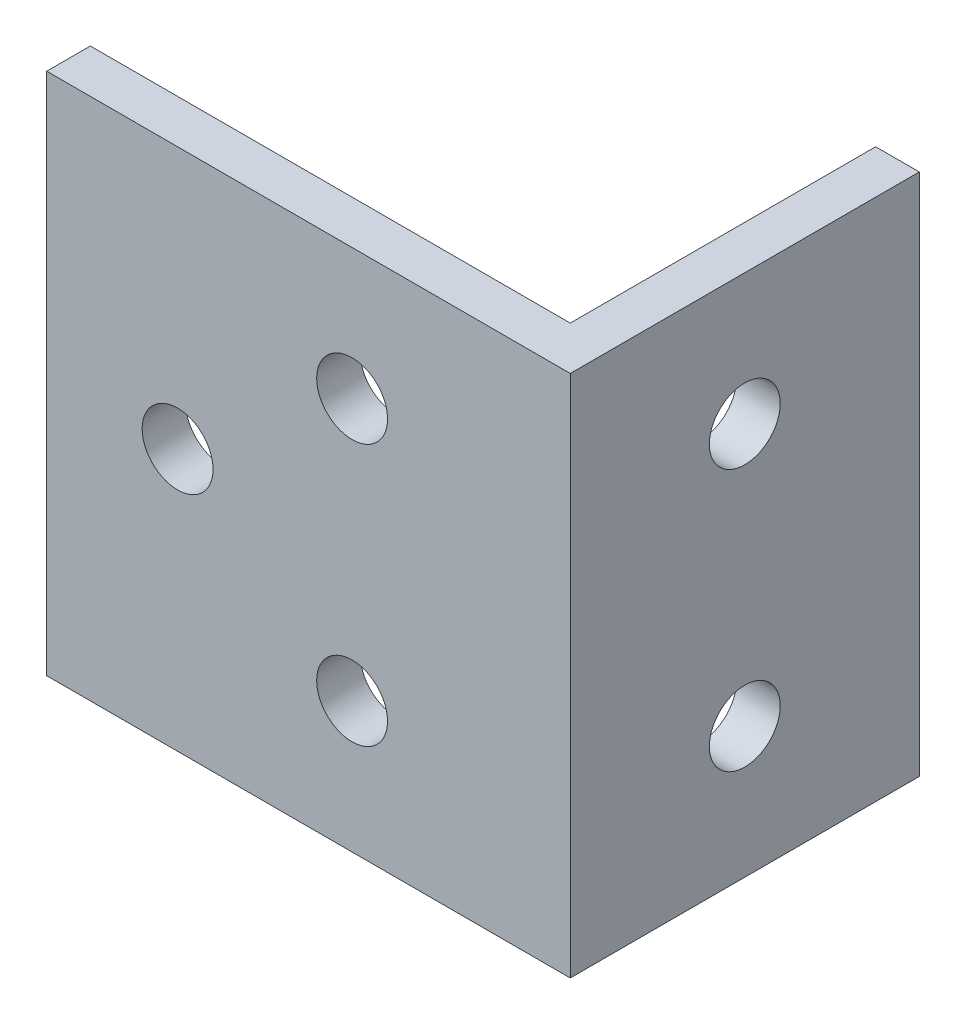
from build123d import *

# Parameters (mm, degrees)
SKETCH1_W          = 152.4
SKETCH1_H          = 152.4
EXTRUDE1_DEPTH     = 12.7
SKETCH2_W          = 12.7
SKETCH2_H          = 152.4
EXTRUDE2_DEPTH     = 88.9
SKETCH3_R          = 10.31875
CUT_EXTRUDE1_DEPTH = 12.7
SKETCH4_R          = 10.31875
CUT_EXTRUDE2_DEPTH = 12.7
SKETCH5_R          = 10.31875
CUT_EXTRUDE3_DEPTH = 12.7
SKETCH6_R          = 10.31875
CUT_EXTRUDE4_DEPTH = 12.7
SKETCH7_R          = 10.31875
CUT_EXTRUDE5_DEPTH = 12.7


with BuildPart() as part:
    # Sketch1 → Extrude1 (new body)
    with BuildSketch(Plane.XY):
        with Locations((-76.2, -76.2)):
            Rectangle(SKETCH1_W, SKETCH1_H)
    extrude(amount=EXTRUDE1_DEPTH)

    # Sketch2 → Extrude2 (add)
    with BuildSketch(Plane(origin=(0, 0, 0), x_dir=(-1, 0, 0), z_dir=(0, 0, -1))):
        with Locations((6.35, -76.2)):
            Rectangle(SKETCH2_W, SKETCH2_H)
    extrude(amount=EXTRUDE2_DEPTH)

    # Sketch3 → Cut-Extrude1 (cut)
    with BuildSketch(Plane(origin=(0, 0, 0), x_dir=(-1, 0, 0), z_dir=(0, 0, -1))):
        with Locations((63.5, -38.1)):
            Circle(SKETCH3_R)
    extrude(amount=-CUT_EXTRUDE1_DEPTH, mode=Mode.SUBTRACT)

    # Sketch4 → Cut-Extrude2 (cut)
    with BuildSketch(Plane(origin=(0, 0, 0), x_dir=(-1, 0, 0), z_dir=(0, 0, -1))):
        with Locations((63.5, -114.3)):
            Circle(SKETCH4_R)
    extrude(amount=-CUT_EXTRUDE2_DEPTH, mode=Mode.SUBTRACT)

    # Sketch5 → Cut-Extrude3 (cut)
    with BuildSketch(Plane(origin=(0, 0, 0), x_dir=(-1, 0, 0), z_dir=(0, 0, -1))):
        with Locations((114.3, -76.2)):
            Circle(SKETCH5_R)
    extrude(amount=-CUT_EXTRUDE3_DEPTH, mode=Mode.SUBTRACT)

    # Sketch6 → Cut-Extrude4 (cut)
    with BuildSketch(Plane(origin=(0, 0, 0), x_dir=(0, 0, -1), z_dir=(1, 0, 0))):
        with Locations(Location((38.1, -38.1, 0), (0, 0, 90))):
            Circle(SKETCH6_R)
    extrude(amount=-CUT_EXTRUDE4_DEPTH, mode=Mode.SUBTRACT)

    # Sketch7 → Cut-Extrude5 (cut)
    with BuildSketch(Plane(origin=(0, 0, 0), x_dir=(0, 0, -1), z_dir=(1, 0, 0))):
        with Locations(Location((38.1, -114.3, 0), (0, 0, 90))):
            Circle(SKETCH7_R)
    extrude(amount=-CUT_EXTRUDE5_DEPTH, mode=Mode.SUBTRACT)


solid = part.part
